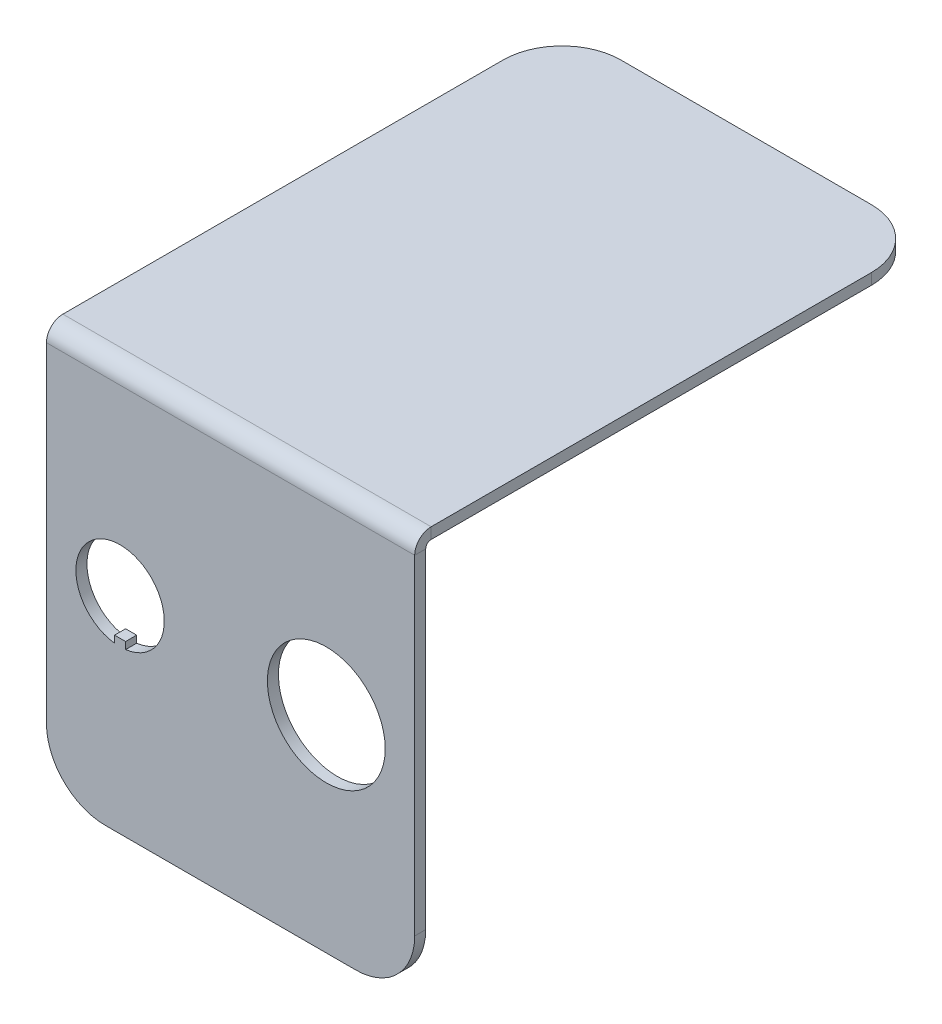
ISO-10303-21;
HEADER;
FILE_DESCRIPTION(('STEP AP214'),'2;1');
FILE_NAME('part.step','',(''),(''),'','','');
FILE_SCHEMA(('AUTOMOTIVE_DESIGN { 1 0 10303 214 1 1 1 1 }'));
ENDSEC;
DATA;
#1=APPLICATION_CONTEXT('core data for automotive mechanical design processes');
#2=APPLICATION_PROTOCOL_DEFINITION('international standard','automotive_design',2000,#1);
#3=PRODUCT_CONTEXT('',#1,'mechanical');
#4=PRODUCT('Part','Part','',(#3));
#5=PRODUCT_RELATED_PRODUCT_CATEGORY('part','',(#4));
#6=PRODUCT_DEFINITION_FORMATION('','',#4);
#7=PRODUCT_DEFINITION_CONTEXT('part definition',#1,'design');
#8=PRODUCT_DEFINITION('design','',#6,#7);
#9=PRODUCT_DEFINITION_SHAPE('','',#8);
#10=(LENGTH_UNIT() NAMED_UNIT(*) SI_UNIT(.MILLI.,.METRE.));
#11=(NAMED_UNIT(*) PLANE_ANGLE_UNIT() SI_UNIT($,.RADIAN.));
#12=(NAMED_UNIT(*) SI_UNIT($,.STERADIAN.) SOLID_ANGLE_UNIT());
#13=UNCERTAINTY_MEASURE_WITH_UNIT(LENGTH_MEASURE(1.E-05),#10,'distance_accuracy_value','');
#14=(GEOMETRIC_REPRESENTATION_CONTEXT(3) GLOBAL_UNCERTAINTY_ASSIGNED_CONTEXT((#13)) GLOBAL_UNIT_ASSIGNED_CONTEXT((#10,
#11,#12)) REPRESENTATION_CONTEXT('',''));
#15=CARTESIAN_POINT('',(0.,0.,0.));
#16=DIRECTION('',(0.,0.,1.));
#17=DIRECTION('',(1.,0.,0.));
#18=AXIS2_PLACEMENT_3D('',#15,#16,#17);
#19=CARTESIAN_POINT('',(-25.,-1.5,70.));
#20=DIRECTION('',(0.,1.,0.));
#21=DIRECTION('',(0.,0.,1.));
#22=AXIS2_PLACEMENT_3D('',#19,#20,#21);
#23=PLANE('',#22);
#24=DIRECTION('',(0.,0.,-1.));
#25=VECTOR('',#24,1.);
#26=CARTESIAN_POINT('',(-25.,-1.5,70.));
#27=LINE('',#26,#25);
#28=CARTESIAN_POINT('',(-25.,-1.5,67.7634));
#29=VERTEX_POINT('',#28);
#30=CARTESIAN_POINT('',(-25.,-1.5,8.));
#31=VERTEX_POINT('',#30);
#32=EDGE_CURVE('E275',#29,#31,#27,.T.);
#33=ORIENTED_EDGE('',*,*,#32,.T.);
#34=CARTESIAN_POINT('',(-17.,-1.5,8.));
#35=DIRECTION('',(0.,1.,0.));
#36=DIRECTION('',(0.,0.,1.));
#37=AXIS2_PLACEMENT_3D('',#34,#35,#36);
#38=CIRCLE('',#37,8.);
#39=CARTESIAN_POINT('',(-17.,-1.5,0.));
#40=VERTEX_POINT('',#39);
#41=EDGE_CURVE('E310',#31,#40,#38,.F.);
#42=ORIENTED_EDGE('',*,*,#41,.T.);
#43=DIRECTION('',(1.,0.,0.));
#44=VECTOR('',#43,1.);
#45=CARTESIAN_POINT('',(-25.,-1.5,0.));
#46=LINE('',#45,#44);
#47=CARTESIAN_POINT('',(17.,-1.5,0.));
#48=VERTEX_POINT('',#47);
#49=EDGE_CURVE('E267',#40,#48,#46,.T.);
#50=ORIENTED_EDGE('',*,*,#49,.T.);
#51=CARTESIAN_POINT('',(17.,-1.5,8.));
#52=DIRECTION('',(0.,1.,0.));
#53=DIRECTION('',(0.,0.,1.));
#54=AXIS2_PLACEMENT_3D('',#51,#52,#53);
#55=CIRCLE('',#54,8.);
#56=CARTESIAN_POINT('',(25.,-1.5,8.));
#57=VERTEX_POINT('',#56);
#58=EDGE_CURVE('E308',#48,#57,#55,.F.);
#59=ORIENTED_EDGE('',*,*,#58,.T.);
#60=DIRECTION('',(0.,0.,-1.));
#61=VECTOR('',#60,1.);
#62=CARTESIAN_POINT('',(25.,-1.5,70.));
#63=LINE('',#62,#61);
#64=CARTESIAN_POINT('',(25.,-1.5,67.7634));
#65=VERTEX_POINT('',#64);
#66=EDGE_CURVE('E284',#65,#57,#63,.T.);
#67=ORIENTED_EDGE('',*,*,#66,.F.);
#68=DIRECTION('',(-1.,0.,0.));
#69=VECTOR('',#68,1.);
#70=CARTESIAN_POINT('',(-25.,-1.5,67.7634));
#71=LINE('',#70,#69);
#72=EDGE_CURVE('E260',#29,#65,#71,.F.);
#73=ORIENTED_EDGE('',*,*,#72,.F.);
#74=EDGE_LOOP('',(#33,#42,#50,#59,#67,#73));
#75=FACE_BOUND('',#74,.T.);
#76=ADVANCED_FACE('F69',(#75),#23,.F.);
#77=CARTESIAN_POINT('',(-25.,0.,70.));
#78=DIRECTION('',(0.,1.,0.));
#79=DIRECTION('',(0.,0.,1.));
#80=AXIS2_PLACEMENT_3D('',#77,#78,#79);
#81=PLANE('',#80);
#82=DIRECTION('',(1.,0.,0.));
#83=VECTOR('',#82,1.);
#84=CARTESIAN_POINT('',(-25.,0.,0.));
#85=LINE('',#84,#83);
#86=CARTESIAN_POINT('',(-17.,0.,0.));
#87=VERTEX_POINT('',#86);
#88=CARTESIAN_POINT('',(17.,0.,0.));
#89=VERTEX_POINT('',#88);
#90=EDGE_CURVE('E272',#87,#89,#85,.T.);
#91=ORIENTED_EDGE('',*,*,#90,.F.);
#92=CARTESIAN_POINT('',(-17.,0.,8.));
#93=DIRECTION('',(0.,1.,0.));
#94=DIRECTION('',(0.,0.,1.));
#95=AXIS2_PLACEMENT_3D('',#92,#93,#94);
#96=CIRCLE('',#95,8.);
#97=CARTESIAN_POINT('',(-25.,0.,8.));
#98=VERTEX_POINT('',#97);
#99=EDGE_CURVE('E304',#87,#98,#96,.T.);
#100=ORIENTED_EDGE('',*,*,#99,.T.);
#101=DIRECTION('',(0.,0.,-1.));
#102=VECTOR('',#101,1.);
#103=CARTESIAN_POINT('',(-25.,0.,70.));
#104=LINE('',#103,#102);
#105=CARTESIAN_POINT('',(-25.,0.,67.7634));
#106=VERTEX_POINT('',#105);
#107=EDGE_CURVE('E278',#106,#98,#104,.T.);
#108=ORIENTED_EDGE('',*,*,#107,.F.);
#109=DIRECTION('',(-1.,0.,0.));
#110=VECTOR('',#109,1.);
#111=CARTESIAN_POINT('',(-25.,0.,67.7634));
#112=LINE('',#111,#110);
#113=CARTESIAN_POINT('',(25.,0.,67.7634));
#114=VERTEX_POINT('',#113);
#115=EDGE_CURVE('E247',#106,#114,#112,.F.);
#116=ORIENTED_EDGE('',*,*,#115,.T.);
#117=DIRECTION('',(0.,0.,-1.));
#118=VECTOR('',#117,1.);
#119=CARTESIAN_POINT('',(25.,0.,70.));
#120=LINE('',#119,#118);
#121=CARTESIAN_POINT('',(25.,0.,8.));
#122=VERTEX_POINT('',#121);
#123=EDGE_CURVE('E281',#114,#122,#120,.T.);
#124=ORIENTED_EDGE('',*,*,#123,.T.);
#125=CARTESIAN_POINT('',(17.,0.,8.));
#126=DIRECTION('',(0.,1.,0.));
#127=DIRECTION('',(0.,0.,1.));
#128=AXIS2_PLACEMENT_3D('',#125,#126,#127);
#129=CIRCLE('',#128,8.);
#130=EDGE_CURVE('E302',#122,#89,#129,.T.);
#131=ORIENTED_EDGE('',*,*,#130,.T.);
#132=EDGE_LOOP('',(#91,#100,#108,#116,#124,#131));
#133=FACE_BOUND('',#132,.T.);
#134=ADVANCED_FACE('F363',(#133),#81,.T.);
#135=CARTESIAN_POINT('',(-25.,-1.5,70.));
#136=DIRECTION('',(-1.,0.,0.));
#137=DIRECTION('',(0.,0.,1.));
#138=AXIS2_PLACEMENT_3D('',#135,#136,#137);
#139=PLANE('',#138);
#140=ORIENTED_EDGE('',*,*,#107,.T.);
#141=DIRECTION('',(0.,1.,0.));
#142=VECTOR('',#141,1.);
#143=CARTESIAN_POINT('',(-25.,-1.5,8.));
#144=LINE('',#143,#142);
#145=EDGE_CURVE('E306',#98,#31,#144,.F.);
#146=ORIENTED_EDGE('',*,*,#145,.T.);
#147=ORIENTED_EDGE('',*,*,#32,.F.);
#148=DIRECTION('',(0.,1.,0.));
#149=VECTOR('',#148,1.);
#150=CARTESIAN_POINT('',(-25.,-1.5,67.7634));
#151=LINE('',#150,#149);
#152=EDGE_CURVE('E254',#29,#106,#151,.T.);
#153=ORIENTED_EDGE('',*,*,#152,.T.);
#154=EDGE_LOOP('',(#140,#146,#147,#153));
#155=FACE_BOUND('',#154,.T.);
#156=ADVANCED_FACE('F379',(#155),#139,.T.);
#157=CARTESIAN_POINT('',(25.,0.,70.));
#158=DIRECTION('',(1.,0.,0.));
#159=DIRECTION('',(0.,0.,-1.));
#160=AXIS2_PLACEMENT_3D('',#157,#158,#159);
#161=PLANE('',#160);
#162=ORIENTED_EDGE('',*,*,#66,.T.);
#163=DIRECTION('',(0.,-1.,0.));
#164=VECTOR('',#163,1.);
#165=CARTESIAN_POINT('',(25.,0.,8.));
#166=LINE('',#165,#164);
#167=EDGE_CURVE('E312',#57,#122,#166,.F.);
#168=ORIENTED_EDGE('',*,*,#167,.T.);
#169=ORIENTED_EDGE('',*,*,#123,.F.);
#170=DIRECTION('',(0.,1.,0.));
#171=VECTOR('',#170,1.);
#172=CARTESIAN_POINT('',(25.,-1.5,67.7634));
#173=LINE('',#172,#171);
#174=EDGE_CURVE('E264',#65,#114,#173,.T.);
#175=ORIENTED_EDGE('',*,*,#174,.F.);
#176=EDGE_LOOP('',(#162,#168,#169,#175));
#177=FACE_BOUND('',#176,.T.);
#178=ADVANCED_FACE('F365',(#177),#161,.T.);
#179=CARTESIAN_POINT('',(0.,0.,0.));
#180=DIRECTION('',(0.,0.,-1.));
#181=DIRECTION('',(-1.,0.,0.));
#182=AXIS2_PLACEMENT_3D('',#179,#180,#181);
#183=PLANE('',#182);
#184=ORIENTED_EDGE('',*,*,#49,.F.);
#185=DIRECTION('',(0.,1.,0.));
#186=VECTOR('',#185,1.);
#187=CARTESIAN_POINT('',(-17.,0.,0.));
#188=LINE('',#187,#186);
#189=EDGE_CURVE('E299',#40,#87,#188,.T.);
#190=ORIENTED_EDGE('',*,*,#189,.T.);
#191=ORIENTED_EDGE('',*,*,#90,.T.);
#192=DIRECTION('',(0.,-1.,0.));
#193=VECTOR('',#192,1.);
#194=CARTESIAN_POINT('',(17.,0.,0.));
#195=LINE('',#194,#193);
#196=EDGE_CURVE('E296',#89,#48,#195,.T.);
#197=ORIENTED_EDGE('',*,*,#196,.T.);
#198=EDGE_LOOP('',(#184,#190,#191,#197));
#199=FACE_BOUND('',#198,.T.);
#200=ADVANCED_FACE('F372',(#199),#183,.T.);
#201=CARTESIAN_POINT('',(25.,-2.23660000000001,67.7634));
#202=DIRECTION('',(1.,0.,0.));
#203=DIRECTION('',(0.,0.,-1.));
#204=AXIS2_PLACEMENT_3D('',#201,#202,#203);
#205=PLANE('',#204);
#206=DIRECTION('',(0.,0.,-1.));
#207=VECTOR('',#206,1.);
#208=CARTESIAN_POINT('',(25.,-2.23660000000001,70.));
#209=LINE('',#208,#207);
#210=CARTESIAN_POINT('',(25.,-2.2366,68.5));
#211=VERTEX_POINT('',#210);
#212=CARTESIAN_POINT('',(25.,-2.2366,70.));
#213=VERTEX_POINT('',#212);
#214=EDGE_CURVE('E244',#211,#213,#209,.F.);
#215=ORIENTED_EDGE('',*,*,#214,.F.);
#216=CARTESIAN_POINT('',(25.,-2.23660000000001,67.7634));
#217=DIRECTION('',(-1.,0.,0.));
#218=DIRECTION('',(0.,0.,1.));
#219=AXIS2_PLACEMENT_3D('',#216,#217,#218);
#220=CIRCLE('',#219,0.736600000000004);
#221=EDGE_CURVE('E257',#65,#211,#220,.F.);
#222=ORIENTED_EDGE('',*,*,#221,.F.);
#223=ORIENTED_EDGE('',*,*,#174,.T.);
#224=CARTESIAN_POINT('',(25.,-2.23660000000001,67.7634));
#225=DIRECTION('',(-1.,0.,0.));
#226=DIRECTION('',(0.,0.,1.));
#227=AXIS2_PLACEMENT_3D('',#224,#225,#226);
#228=CIRCLE('',#227,2.2366);
#229=EDGE_CURVE('E250',#114,#213,#228,.F.);
#230=ORIENTED_EDGE('',*,*,#229,.T.);
#231=EDGE_LOOP('',(#215,#222,#223,#230));
#232=FACE_BOUND('',#231,.T.);
#233=ADVANCED_FACE('F354',(#232),#205,.T.);
#234=CARTESIAN_POINT('',(-25.,-2.23660000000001,67.7634));
#235=DIRECTION('',(1.,0.,0.));
#236=DIRECTION('',(0.,0.,-1.));
#237=AXIS2_PLACEMENT_3D('',#234,#235,#236);
#238=PLANE('',#237);
#239=CARTESIAN_POINT('',(-25.,-2.23660000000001,67.7634));
#240=DIRECTION('',(-1.,0.,0.));
#241=DIRECTION('',(0.,0.,1.));
#242=AXIS2_PLACEMENT_3D('',#239,#240,#241);
#243=CIRCLE('',#242,0.736600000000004);
#244=CARTESIAN_POINT('',(-25.,-2.2366,68.5));
#245=VERTEX_POINT('',#244);
#246=EDGE_CURVE('E225',#245,#29,#243,.T.);
#247=ORIENTED_EDGE('',*,*,#246,.F.);
#248=DIRECTION('',(0.,0.,-1.));
#249=VECTOR('',#248,1.);
#250=CARTESIAN_POINT('',(-25.,-2.23660000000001,68.5));
#251=LINE('',#250,#249);
#252=CARTESIAN_POINT('',(-25.,-2.23660000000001,70.));
#253=VERTEX_POINT('',#252);
#254=EDGE_CURVE('E239',#245,#253,#251,.F.);
#255=ORIENTED_EDGE('',*,*,#254,.T.);
#256=CARTESIAN_POINT('',(-25.,-2.23660000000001,67.7634));
#257=DIRECTION('',(-1.,0.,0.));
#258=DIRECTION('',(0.,0.,1.));
#259=AXIS2_PLACEMENT_3D('',#256,#257,#258);
#260=CIRCLE('',#259,2.2366);
#261=EDGE_CURVE('E251',#253,#106,#260,.T.);
#262=ORIENTED_EDGE('',*,*,#261,.T.);
#263=ORIENTED_EDGE('',*,*,#152,.F.);
#264=EDGE_LOOP('',(#247,#255,#262,#263));
#265=FACE_BOUND('',#264,.T.);
#266=ADVANCED_FACE('F350',(#265),#238,.F.);
#267=CARTESIAN_POINT('',(-25.,-2.23660000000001,67.7634));
#268=DIRECTION('',(-1.,0.,0.));
#269=DIRECTION('',(0.,0.,1.));
#270=AXIS2_PLACEMENT_3D('',#267,#268,#269);
#271=CYLINDRICAL_SURFACE('',#270,2.2366);
#272=ORIENTED_EDGE('',*,*,#115,.F.);
#273=ORIENTED_EDGE('',*,*,#261,.F.);
#274=DIRECTION('',(-1.,0.,0.));
#275=VECTOR('',#274,1.);
#276=CARTESIAN_POINT('',(25.,-2.23660000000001,70.));
#277=LINE('',#276,#275);
#278=EDGE_CURVE('E236',#253,#213,#277,.F.);
#279=ORIENTED_EDGE('',*,*,#278,.T.);
#280=ORIENTED_EDGE('',*,*,#229,.F.);
#281=EDGE_LOOP('',(#272,#273,#279,#280));
#282=FACE_BOUND('',#281,.T.);
#283=ADVANCED_FACE('F352',(#282),#271,.T.);
#284=CARTESIAN_POINT('',(-25.,-2.23660000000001,67.7634));
#285=DIRECTION('',(-1.,0.,0.));
#286=DIRECTION('',(0.,0.,1.));
#287=AXIS2_PLACEMENT_3D('',#284,#285,#286);
#288=CYLINDRICAL_SURFACE('',#287,0.736600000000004);
#289=ORIENTED_EDGE('',*,*,#72,.T.);
#290=ORIENTED_EDGE('',*,*,#221,.T.);
#291=DIRECTION('',(-1.,0.,0.));
#292=VECTOR('',#291,1.);
#293=CARTESIAN_POINT('',(25.,-2.23660000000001,68.5));
#294=LINE('',#293,#292);
#295=EDGE_CURVE('E242',#211,#245,#294,.T.);
#296=ORIENTED_EDGE('',*,*,#295,.T.);
#297=ORIENTED_EDGE('',*,*,#246,.T.);
#298=EDGE_LOOP('',(#289,#290,#296,#297));
#299=FACE_BOUND('',#298,.T.);
#300=ADVANCED_FACE('F383',(#299),#288,.F.);
#301=CARTESIAN_POINT('',(-25.,-55.,70.0000000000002));
#302=DIRECTION('',(1.,0.,0.));
#303=DIRECTION('',(0.,1.,0.));
#304=AXIS2_PLACEMENT_3D('',#301,#302,#303);
#305=PLANE('',#304);
#306=DIRECTION('',(0.,1.,0.));
#307=VECTOR('',#306,1.);
#308=CARTESIAN_POINT('',(-25.,-55.,68.5000000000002));
#309=LINE('',#308,#307);
#310=CARTESIAN_POINT('',(-25.,-47.,68.5000000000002));
#311=VERTEX_POINT('',#310);
#312=EDGE_CURVE('E234',#245,#311,#309,.F.);
#313=ORIENTED_EDGE('',*,*,#312,.T.);
#314=DIRECTION('',(0.,0.,-1.));
#315=VECTOR('',#314,1.);
#316=CARTESIAN_POINT('',(-25.,-47.,70.0000000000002));
#317=LINE('',#316,#315);
#318=CARTESIAN_POINT('',(-25.,-47.,70.0000000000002));
#319=VERTEX_POINT('',#318);
#320=EDGE_CURVE('E15',#311,#319,#317,.F.);
#321=ORIENTED_EDGE('',*,*,#320,.T.);
#322=DIRECTION('',(0.,-1.,0.));
#323=VECTOR('',#322,1.);
#324=CARTESIAN_POINT('',(-25.,2.38046839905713E-13,70.));
#325=LINE('',#324,#323);
#326=EDGE_CURVE('E228',#253,#319,#325,.T.);
#327=ORIENTED_EDGE('',*,*,#326,.F.);
#328=ORIENTED_EDGE('',*,*,#254,.F.);
#329=EDGE_LOOP('',(#313,#321,#327,#328));
#330=FACE_BOUND('',#329,.T.);
#331=ADVANCED_FACE('F347',(#330),#305,.F.);
#332=CARTESIAN_POINT('',(25.,-1.49999999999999,70.));
#333=DIRECTION('',(-1.,0.,0.));
#334=DIRECTION('',(0.,0.,1.));
#335=AXIS2_PLACEMENT_3D('',#332,#333,#334);
#336=PLANE('',#335);
#337=DIRECTION('',(0.,1.,0.));
#338=VECTOR('',#337,1.);
#339=CARTESIAN_POINT('',(25.,2.41289313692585E-13,70.));
#340=LINE('',#339,#338);
#341=CARTESIAN_POINT('',(25.,-47.,70.0000000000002));
#342=VERTEX_POINT('',#341);
#343=EDGE_CURVE('E223',#342,#213,#340,.T.);
#344=ORIENTED_EDGE('',*,*,#343,.F.);
#345=DIRECTION('',(0.,0.,-1.));
#346=VECTOR('',#345,1.);
#347=CARTESIAN_POINT('',(25.,-47.,70.0000000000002));
#348=LINE('',#347,#346);
#349=CARTESIAN_POINT('',(25.,-47.,68.5000000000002));
#350=VERTEX_POINT('',#349);
#351=EDGE_CURVE('E314',#342,#350,#348,.T.);
#352=ORIENTED_EDGE('',*,*,#351,.T.);
#353=DIRECTION('',(0.,-1.,0.));
#354=VECTOR('',#353,1.);
#355=CARTESIAN_POINT('',(25.,-1.5,68.5));
#356=LINE('',#355,#354);
#357=EDGE_CURVE('E230',#350,#211,#356,.F.);
#358=ORIENTED_EDGE('',*,*,#357,.T.);
#359=ORIENTED_EDGE('',*,*,#214,.T.);
#360=EDGE_LOOP('',(#344,#352,#358,#359));
#361=FACE_BOUND('',#360,.T.);
#362=ADVANCED_FACE('F333',(#361),#336,.F.);
#363=CARTESIAN_POINT('',(0.,2.41289313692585E-13,70.));
#364=DIRECTION('',(0.,0.,-1.));
#365=DIRECTION('',(0.,1.,0.));
#366=AXIS2_PLACEMENT_3D('',#363,#364,#365);
#367=PLANE('',#366);
#368=DIRECTION('',(0.,1.,0.));
#369=VECTOR('',#368,1.);
#370=CARTESIAN_POINT('',(-15.75,-32.9529404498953,70.));
#371=LINE('',#370,#369);
#372=CARTESIAN_POINT('',(-15.75,-32.9529404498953,70.0000000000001));
#373=VERTEX_POINT('',#372);
#374=CARTESIAN_POINT('',(-15.75,-32.,70.));
#375=VERTEX_POINT('',#374);
#376=EDGE_CURVE('E200',#373,#375,#371,.T.);
#377=ORIENTED_EDGE('',*,*,#376,.F.);
#378=CARTESIAN_POINT('',(-15.,-27.,70.));
#379=DIRECTION('',(0.,0.,1.));
#380=DIRECTION('',(1.,0.,0.));
#381=AXIS2_PLACEMENT_3D('',#378,#379,#380);
#382=CIRCLE('',#381,6.);
#383=CARTESIAN_POINT('',(-14.25,-32.9529404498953,70.));
#384=VERTEX_POINT('',#383);
#385=EDGE_CURVE('E205',#384,#373,#382,.T.);
#386=ORIENTED_EDGE('',*,*,#385,.F.);
#387=DIRECTION('',(0.,-1.,0.));
#388=VECTOR('',#387,1.);
#389=CARTESIAN_POINT('',(-14.25,-32.,70.));
#390=LINE('',#389,#388);
#391=CARTESIAN_POINT('',(-14.25,-32.,70.));
#392=VERTEX_POINT('',#391);
#393=EDGE_CURVE('E210',#392,#384,#390,.T.);
#394=ORIENTED_EDGE('',*,*,#393,.F.);
#395=DIRECTION('',(1.,0.,0.));
#396=VECTOR('',#395,1.);
#397=CARTESIAN_POINT('',(-15.75,-32.,70.));
#398=LINE('',#397,#396);
#399=EDGE_CURVE('E189',#375,#392,#398,.T.);
#400=ORIENTED_EDGE('',*,*,#399,.F.);
#401=EDGE_LOOP('',(#377,#386,#394,#400));
#402=FACE_BOUND('',#401,.T.);
#403=CARTESIAN_POINT('',(13.,-27.,70.));
#404=DIRECTION('',(0.,0.,1.));
#405=DIRECTION('',(1.,0.,0.));
#406=AXIS2_PLACEMENT_3D('',#403,#404,#405);
#407=CIRCLE('',#406,8.);
#408=CARTESIAN_POINT('',(21.,-27.,70.));
#409=VERTEX_POINT('',#408);
#410=EDGE_CURVE('E217',#409,#409,#407,.T.);
#411=ORIENTED_EDGE('',*,*,#410,.F.);
#412=EDGE_LOOP('',(#411));
#413=FACE_BOUND('',#412,.T.);
#414=DIRECTION('',(1.,0.,0.));
#415=VECTOR('',#414,1.);
#416=CARTESIAN_POINT('',(0.,-55.,70.0000000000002));
#417=LINE('',#416,#415);
#418=CARTESIAN_POINT('',(-17.,-55.,70.0000000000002));
#419=VERTEX_POINT('',#418);
#420=CARTESIAN_POINT('',(17.,-55.,70.0000000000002));
#421=VERTEX_POINT('',#420);
#422=EDGE_CURVE('E226',#419,#421,#417,.T.);
#423=ORIENTED_EDGE('',*,*,#422,.T.);
#424=CARTESIAN_POINT('',(17.,-47.,70.0000000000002));
#425=DIRECTION('',(0.,0.,-1.));
#426=DIRECTION('',(0.,1.,0.));
#427=AXIS2_PLACEMENT_3D('',#424,#425,#426);
#428=CIRCLE('',#427,8.);
#429=EDGE_CURVE('E77',#421,#342,#428,.F.);
#430=ORIENTED_EDGE('',*,*,#429,.T.);
#431=ORIENTED_EDGE('',*,*,#343,.T.);
#432=ORIENTED_EDGE('',*,*,#278,.F.);
#433=ORIENTED_EDGE('',*,*,#326,.T.);
#434=CARTESIAN_POINT('',(-17.,-47.,70.0000000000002));
#435=DIRECTION('',(0.,0.,-1.));
#436=DIRECTION('',(0.,1.,0.));
#437=AXIS2_PLACEMENT_3D('',#434,#435,#436);
#438=CIRCLE('',#437,8.);
#439=EDGE_CURVE('E325',#319,#419,#438,.F.);
#440=ORIENTED_EDGE('',*,*,#439,.T.);
#441=EDGE_LOOP('',(#423,#430,#431,#432,#433,#440));
#442=FACE_BOUND('',#441,.T.);
#443=ADVANCED_FACE('F207',(#402,#413,#442),#367,.F.);
#444=CARTESIAN_POINT('',(0.,2.36052091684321E-13,68.5));
#445=DIRECTION('',(0.,0.,-1.));
#446=DIRECTION('',(0.,1.,0.));
#447=AXIS2_PLACEMENT_3D('',#444,#445,#446);
#448=PLANE('',#447);
#449=CARTESIAN_POINT('',(-15.,-27.,68.5000000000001));
#450=DIRECTION('',(0.,0.,-1.));
#451=DIRECTION('',(0.,1.,0.));
#452=AXIS2_PLACEMENT_3D('',#449,#450,#451);
#453=CIRCLE('',#452,6.);
#454=CARTESIAN_POINT('',(-15.75,-32.9529404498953,68.5000000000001));
#455=VERTEX_POINT('',#454);
#456=CARTESIAN_POINT('',(-14.25,-32.9529404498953,68.5000000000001));
#457=VERTEX_POINT('',#456);
#458=EDGE_CURVE('E294',#455,#457,#453,.T.);
#459=ORIENTED_EDGE('',*,*,#458,.F.);
#460=DIRECTION('',(0.,-1.,0.));
#461=VECTOR('',#460,1.);
#462=CARTESIAN_POINT('',(-15.75,2.36052091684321E-13,68.5));
#463=LINE('',#462,#461);
#464=CARTESIAN_POINT('',(-15.75,-32.,68.5000000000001));
#465=VERTEX_POINT('',#464);
#466=EDGE_CURVE('E287',#465,#455,#463,.T.);
#467=ORIENTED_EDGE('',*,*,#466,.F.);
#468=DIRECTION('',(-1.,0.,0.));
#469=VECTOR('',#468,1.);
#470=CARTESIAN_POINT('',(0.,-32.,68.5000000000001));
#471=LINE('',#470,#469);
#472=CARTESIAN_POINT('',(-14.25,-32.,68.5000000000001));
#473=VERTEX_POINT('',#472);
#474=EDGE_CURVE('E192',#473,#465,#471,.T.);
#475=ORIENTED_EDGE('',*,*,#474,.F.);
#476=DIRECTION('',(0.,1.,0.));
#477=VECTOR('',#476,1.);
#478=CARTESIAN_POINT('',(-14.25,2.36052091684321E-13,68.5));
#479=LINE('',#478,#477);
#480=EDGE_CURVE('E292',#457,#473,#479,.T.);
#481=ORIENTED_EDGE('',*,*,#480,.F.);
#482=EDGE_LOOP('',(#459,#467,#475,#481));
#483=FACE_BOUND('',#482,.T.);
#484=CARTESIAN_POINT('',(13.,-27.,68.5000000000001));
#485=DIRECTION('',(0.,0.,-1.));
#486=DIRECTION('',(0.,1.,0.));
#487=AXIS2_PLACEMENT_3D('',#484,#485,#486);
#488=CIRCLE('',#487,8.);
#489=CARTESIAN_POINT('',(13.,-19.,68.5000000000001));
#490=VERTEX_POINT('',#489);
#491=EDGE_CURVE('E222',#490,#490,#488,.T.);
#492=ORIENTED_EDGE('',*,*,#491,.F.);
#493=EDGE_LOOP('',(#492));
#494=FACE_BOUND('',#493,.T.);
#495=ORIENTED_EDGE('',*,*,#357,.F.);
#496=CARTESIAN_POINT('',(17.,-47.,68.5000000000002));
#497=DIRECTION('',(0.,0.,-1.));
#498=DIRECTION('',(0.,1.,0.));
#499=AXIS2_PLACEMENT_3D('',#496,#497,#498);
#500=CIRCLE('',#499,8.);
#501=CARTESIAN_POINT('',(17.,-55.,68.5000000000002));
#502=VERTEX_POINT('',#501);
#503=EDGE_CURVE('E319',#350,#502,#500,.T.);
#504=ORIENTED_EDGE('',*,*,#503,.T.);
#505=DIRECTION('',(-1.,0.,0.));
#506=VECTOR('',#505,1.);
#507=CARTESIAN_POINT('',(25.,-55.,68.5000000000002));
#508=LINE('',#507,#506);
#509=CARTESIAN_POINT('',(-17.,-55.,68.5000000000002));
#510=VERTEX_POINT('',#509);
#511=EDGE_CURVE('E232',#510,#502,#508,.F.);
#512=ORIENTED_EDGE('',*,*,#511,.F.);
#513=CARTESIAN_POINT('',(-17.,-47.,68.5000000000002));
#514=DIRECTION('',(0.,0.,-1.));
#515=DIRECTION('',(0.,1.,0.));
#516=AXIS2_PLACEMENT_3D('',#513,#514,#515);
#517=CIRCLE('',#516,8.);
#518=EDGE_CURVE('E317',#510,#311,#517,.T.);
#519=ORIENTED_EDGE('',*,*,#518,.T.);
#520=ORIENTED_EDGE('',*,*,#312,.F.);
#521=ORIENTED_EDGE('',*,*,#295,.F.);
#522=EDGE_LOOP('',(#495,#504,#512,#519,#520,#521));
#523=FACE_BOUND('',#522,.T.);
#524=ADVANCED_FACE('F339',(#483,#494,#523),#448,.T.);
#525=CARTESIAN_POINT('',(25.,-55.,70.0000000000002));
#526=DIRECTION('',(0.,1.,0.));
#527=DIRECTION('',(0.,0.,1.));
#528=AXIS2_PLACEMENT_3D('',#525,#526,#527);
#529=PLANE('',#528);
#530=ORIENTED_EDGE('',*,*,#511,.T.);
#531=DIRECTION('',(0.,0.,-1.));
#532=VECTOR('',#531,1.);
#533=CARTESIAN_POINT('',(17.,-55.,70.0000000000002));
#534=LINE('',#533,#532);
#535=EDGE_CURVE('E90',#502,#421,#534,.F.);
#536=ORIENTED_EDGE('',*,*,#535,.T.);
#537=ORIENTED_EDGE('',*,*,#422,.F.);
#538=DIRECTION('',(0.,0.,-1.));
#539=VECTOR('',#538,1.);
#540=CARTESIAN_POINT('',(-17.,-55.,70.0000000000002));
#541=LINE('',#540,#539);
#542=EDGE_CURVE('E321',#419,#510,#541,.T.);
#543=ORIENTED_EDGE('',*,*,#542,.T.);
#544=EDGE_LOOP('',(#530,#536,#537,#543));
#545=FACE_BOUND('',#544,.T.);
#546=ADVANCED_FACE('F341',(#545),#529,.F.);
#547=CARTESIAN_POINT('',(13.,-27.,0.));
#548=DIRECTION('',(0.,0.,1.));
#549=DIRECTION('',(1.,0.,0.));
#550=AXIS2_PLACEMENT_3D('',#547,#548,#549);
#551=CYLINDRICAL_SURFACE('',#550,8.);
#552=ORIENTED_EDGE('',*,*,#491,.T.);
#553=EDGE_LOOP('',(#552));
#554=FACE_BOUND('',#553,.T.);
#555=ORIENTED_EDGE('',*,*,#410,.T.);
#556=EDGE_LOOP('',(#555));
#557=FACE_BOUND('',#556,.T.);
#558=ADVANCED_FACE('F429',(#554,#557),#551,.F.);
#559=CARTESIAN_POINT('',(-15.,-27.,0.));
#560=DIRECTION('',(0.,0.,1.));
#561=DIRECTION('',(1.,0.,0.));
#562=AXIS2_PLACEMENT_3D('',#559,#560,#561);
#563=CYLINDRICAL_SURFACE('',#562,6.);
#564=ORIENTED_EDGE('',*,*,#458,.T.);
#565=DIRECTION('',(0.,0.,1.));
#566=VECTOR('',#565,1.);
#567=CARTESIAN_POINT('',(-14.25,-32.9529404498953,0.));
#568=LINE('',#567,#566);
#569=EDGE_CURVE('E215',#457,#384,#568,.T.);
#570=ORIENTED_EDGE('',*,*,#569,.T.);
#571=ORIENTED_EDGE('',*,*,#385,.T.);
#572=DIRECTION('',(0.,0.,1.));
#573=VECTOR('',#572,1.);
#574=CARTESIAN_POINT('',(-15.75,-32.9529404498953,0.));
#575=LINE('',#574,#573);
#576=EDGE_CURVE('E196',#455,#373,#575,.T.);
#577=ORIENTED_EDGE('',*,*,#576,.F.);
#578=EDGE_LOOP('',(#564,#570,#571,#577));
#579=FACE_BOUND('',#578,.T.);
#580=ADVANCED_FACE('F534',(#579),#563,.F.);
#581=CARTESIAN_POINT('',(-14.25,-32.,0.));
#582=DIRECTION('',(-1.,0.,0.));
#583=DIRECTION('',(0.,0.,1.));
#584=AXIS2_PLACEMENT_3D('',#581,#582,#583);
#585=PLANE('',#584);
#586=ORIENTED_EDGE('',*,*,#480,.T.);
#587=DIRECTION('',(0.,0.,1.));
#588=VECTOR('',#587,1.);
#589=CARTESIAN_POINT('',(-14.25,-32.,0.));
#590=LINE('',#589,#588);
#591=EDGE_CURVE('E195',#473,#392,#590,.T.);
#592=ORIENTED_EDGE('',*,*,#591,.T.);
#593=ORIENTED_EDGE('',*,*,#393,.T.);
#594=ORIENTED_EDGE('',*,*,#569,.F.);
#595=EDGE_LOOP('',(#586,#592,#593,#594));
#596=FACE_BOUND('',#595,.T.);
#597=ADVANCED_FACE('F524',(#596),#585,.F.);
#598=CARTESIAN_POINT('',(-15.75,-32.,0.));
#599=DIRECTION('',(0.,-1.,0.));
#600=DIRECTION('',(0.,0.,-1.));
#601=AXIS2_PLACEMENT_3D('',#598,#599,#600);
#602=PLANE('',#601);
#603=ORIENTED_EDGE('',*,*,#474,.T.);
#604=DIRECTION('',(0.,0.,1.));
#605=VECTOR('',#604,1.);
#606=CARTESIAN_POINT('',(-15.75,-32.,0.));
#607=LINE('',#606,#605);
#608=EDGE_CURVE('E184',#465,#375,#607,.T.);
#609=ORIENTED_EDGE('',*,*,#608,.T.);
#610=ORIENTED_EDGE('',*,*,#399,.T.);
#611=ORIENTED_EDGE('',*,*,#591,.F.);
#612=EDGE_LOOP('',(#603,#609,#610,#611));
#613=FACE_BOUND('',#612,.T.);
#614=ADVANCED_FACE('F186',(#613),#602,.F.);
#615=CARTESIAN_POINT('',(-15.75,-32.9529404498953,0.));
#616=DIRECTION('',(1.,0.,0.));
#617=DIRECTION('',(0.,0.,-1.));
#618=AXIS2_PLACEMENT_3D('',#615,#616,#617);
#619=PLANE('',#618);
#620=ORIENTED_EDGE('',*,*,#466,.T.);
#621=ORIENTED_EDGE('',*,*,#576,.T.);
#622=ORIENTED_EDGE('',*,*,#376,.T.);
#623=ORIENTED_EDGE('',*,*,#608,.F.);
#624=EDGE_LOOP('',(#620,#621,#622,#623));
#625=FACE_BOUND('',#624,.T.);
#626=ADVANCED_FACE('F201',(#625),#619,.F.);
#627=CARTESIAN_POINT('',(-17.,0.,8.));
#628=DIRECTION('',(0.,1.,0.));
#629=DIRECTION('',(0.,0.,1.));
#630=AXIS2_PLACEMENT_3D('',#627,#628,#629);
#631=CYLINDRICAL_SURFACE('',#630,8.);
#632=ORIENTED_EDGE('',*,*,#41,.F.);
#633=ORIENTED_EDGE('',*,*,#145,.F.);
#634=ORIENTED_EDGE('',*,*,#99,.F.);
#635=ORIENTED_EDGE('',*,*,#189,.F.);
#636=EDGE_LOOP('',(#632,#633,#634,#635));
#637=FACE_BOUND('',#636,.T.);
#638=ADVANCED_FACE('F376',(#637),#631,.T.);
#639=CARTESIAN_POINT('',(17.,0.,8.));
#640=DIRECTION('',(0.,-1.,0.));
#641=DIRECTION('',(0.,0.,-1.));
#642=AXIS2_PLACEMENT_3D('',#639,#640,#641);
#643=CYLINDRICAL_SURFACE('',#642,8.);
#644=ORIENTED_EDGE('',*,*,#130,.F.);
#645=ORIENTED_EDGE('',*,*,#167,.F.);
#646=ORIENTED_EDGE('',*,*,#58,.F.);
#647=ORIENTED_EDGE('',*,*,#196,.F.);
#648=EDGE_LOOP('',(#644,#645,#646,#647));
#649=FACE_BOUND('',#648,.T.);
#650=ADVANCED_FACE('F368',(#649),#643,.T.);
#651=CARTESIAN_POINT('',(17.,-47.,70.0000000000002));
#652=DIRECTION('',(0.,0.,-1.));
#653=DIRECTION('',(0.,1.,0.));
#654=AXIS2_PLACEMENT_3D('',#651,#652,#653);
#655=CYLINDRICAL_SURFACE('',#654,8.);
#656=ORIENTED_EDGE('',*,*,#429,.F.);
#657=ORIENTED_EDGE('',*,*,#535,.F.);
#658=ORIENTED_EDGE('',*,*,#503,.F.);
#659=ORIENTED_EDGE('',*,*,#351,.F.);
#660=EDGE_LOOP('',(#656,#657,#658,#659));
#661=FACE_BOUND('',#660,.T.);
#662=ADVANCED_FACE('F336',(#661),#655,.T.);
#663=CARTESIAN_POINT('',(-17.,-47.,70.0000000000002));
#664=DIRECTION('',(0.,0.,-1.));
#665=DIRECTION('',(0.,1.,0.));
#666=AXIS2_PLACEMENT_3D('',#663,#664,#665);
#667=CYLINDRICAL_SURFACE('',#666,8.);
#668=ORIENTED_EDGE('',*,*,#439,.F.);
#669=ORIENTED_EDGE('',*,*,#320,.F.);
#670=ORIENTED_EDGE('',*,*,#518,.F.);
#671=ORIENTED_EDGE('',*,*,#542,.F.);
#672=EDGE_LOOP('',(#668,#669,#670,#671));
#673=FACE_BOUND('',#672,.T.);
#674=ADVANCED_FACE('F71',(#673),#667,.T.);
#675=CLOSED_SHELL('',(#76,#134,#156,#178,#200,#233,#266,#283,#300,#331,#362,#443,#524,#546,#558,
#580,#597,#614,#626,#638,#650,#662,#674));
#676=MANIFOLD_SOLID_BREP('B2',#675);
#677=ADVANCED_BREP_SHAPE_REPRESENTATION('',(#18,#676),#14);
#678=SHAPE_DEFINITION_REPRESENTATION(#9,#677);
ENDSEC;
END-ISO-10303-21;
